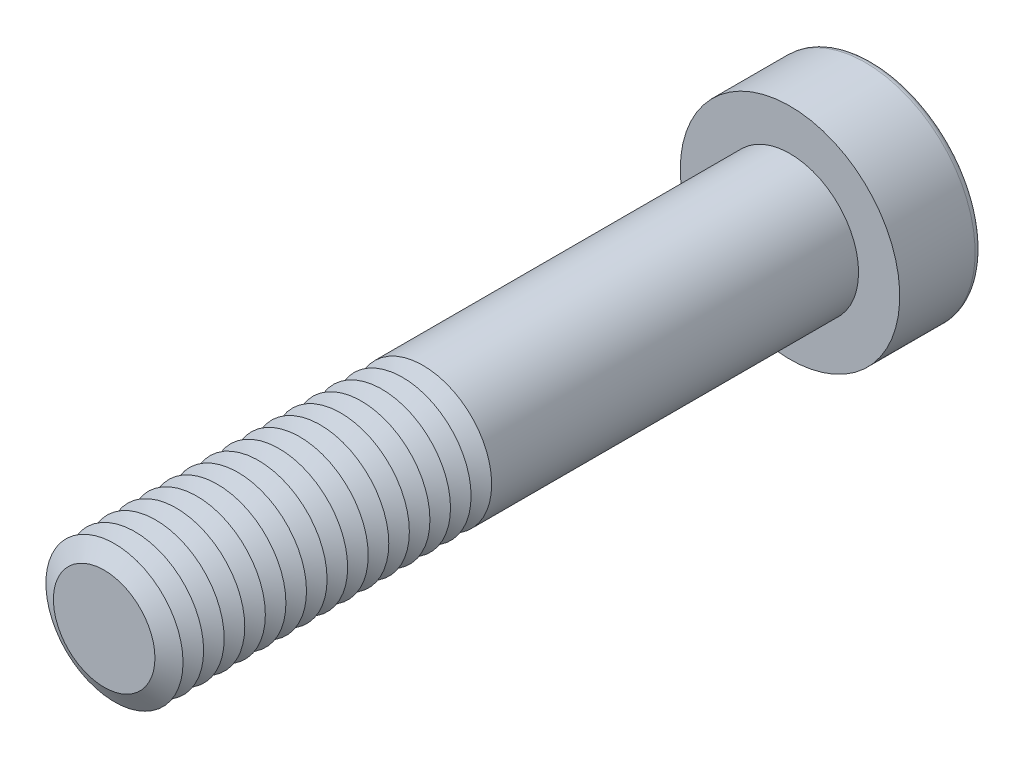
ISO-10303-21;
HEADER;
FILE_DESCRIPTION(('STEP AP214'),'2;1');
FILE_NAME('part.step','',(''),(''),'','','');
FILE_SCHEMA(('AUTOMOTIVE_DESIGN { 1 0 10303 214 1 1 1 1 }'));
ENDSEC;
DATA;
#1=APPLICATION_CONTEXT('core data for automotive mechanical design processes');
#2=APPLICATION_PROTOCOL_DEFINITION('international standard','automotive_design',2000,#1);
#3=PRODUCT_CONTEXT('',#1,'mechanical');
#4=PRODUCT('Part','Part','',(#3));
#5=PRODUCT_RELATED_PRODUCT_CATEGORY('part','',(#4));
#6=PRODUCT_DEFINITION_FORMATION('','',#4);
#7=PRODUCT_DEFINITION_CONTEXT('part definition',#1,'design');
#8=PRODUCT_DEFINITION('design','',#6,#7);
#9=PRODUCT_DEFINITION_SHAPE('','',#8);
#10=(LENGTH_UNIT() NAMED_UNIT(*) SI_UNIT(.MILLI.,.METRE.));
#11=(NAMED_UNIT(*) PLANE_ANGLE_UNIT() SI_UNIT($,.RADIAN.));
#12=(NAMED_UNIT(*) SI_UNIT($,.STERADIAN.) SOLID_ANGLE_UNIT());
#13=UNCERTAINTY_MEASURE_WITH_UNIT(LENGTH_MEASURE(1.E-05),#10,'distance_accuracy_value','');
#14=(GEOMETRIC_REPRESENTATION_CONTEXT(3) GLOBAL_UNCERTAINTY_ASSIGNED_CONTEXT((#13)) GLOBAL_UNIT_ASSIGNED_CONTEXT((#10,
#11,#12)) REPRESENTATION_CONTEXT('',''));
#15=CARTESIAN_POINT('',(0.,0.,0.));
#16=DIRECTION('',(0.,0.,1.));
#17=DIRECTION('',(1.,0.,0.));
#18=AXIS2_PLACEMENT_3D('',#15,#16,#17);
#19=CARTESIAN_POINT('',(0.,0.,44.75));
#20=DIRECTION('',(0.,0.,1.));
#21=DIRECTION('',(1.,0.,0.));
#22=AXIS2_PLACEMENT_3D('',#19,#20,#21);
#23=CONICAL_SURFACE('',#22,5.,1.0471975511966);
#24=CARTESIAN_POINT('',(0.,0.,44.));
#25=DIRECTION('',(0.,0.,1.));
#26=DIRECTION('',(1.,0.,0.));
#27=AXIS2_PLACEMENT_3D('',#24,#25,#26);
#28=CIRCLE('',#27,3.70096189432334);
#29=CARTESIAN_POINT('',(3.70096189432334,0.,44.));
#30=VERTEX_POINT('',#29);
#31=EDGE_CURVE('E314',#30,#30,#28,.T.);
#32=ORIENTED_EDGE('',*,*,#31,.T.);
#33=EDGE_LOOP('',(#32));
#34=FACE_BOUND('',#33,.T.);
#35=CARTESIAN_POINT('',(0.,0.,44.75));
#36=DIRECTION('',(0.,0.,1.));
#37=DIRECTION('',(1.,0.,0.));
#38=AXIS2_PLACEMENT_3D('',#35,#36,#37);
#39=CIRCLE('',#38,5.);
#40=CARTESIAN_POINT('',(5.,0.,44.75));
#41=VERTEX_POINT('',#40);
#42=EDGE_CURVE('E317',#41,#41,#39,.T.);
#43=ORIENTED_EDGE('',*,*,#42,.F.);
#44=EDGE_LOOP('',(#43));
#45=FACE_BOUND('',#44,.T.);
#46=ADVANCED_FACE('F39',(#34,#45),#23,.T.);
#47=CARTESIAN_POINT('',(0.,0.,44.));
#48=DIRECTION('',(0.,0.,-1.));
#49=DIRECTION('',(-1.,0.,0.));
#50=AXIS2_PLACEMENT_3D('',#47,#48,#49);
#51=CONICAL_SURFACE('',#50,3.70096189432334,1.0471975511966);
#52=CARTESIAN_POINT('',(0.,0.,43.25));
#53=DIRECTION('',(0.,0.,1.));
#54=DIRECTION('',(1.,0.,0.));
#55=AXIS2_PLACEMENT_3D('',#52,#53,#54);
#56=CIRCLE('',#55,5.);
#57=CARTESIAN_POINT('',(5.,0.,43.25));
#58=VERTEX_POINT('',#57);
#59=EDGE_CURVE('E325',#58,#58,#56,.T.);
#60=ORIENTED_EDGE('',*,*,#59,.T.);
#61=EDGE_LOOP('',(#60));
#62=FACE_BOUND('',#61,.T.);
#63=ORIENTED_EDGE('',*,*,#31,.F.);
#64=EDGE_LOOP('',(#63));
#65=FACE_BOUND('',#64,.T.);
#66=ADVANCED_FACE('F245',(#62,#65),#51,.T.);
#67=CARTESIAN_POINT('',(0.,0.,50.));
#68=DIRECTION('',(0.,0.,1.));
#69=DIRECTION('',(1.,0.,0.));
#70=AXIS2_PLACEMENT_3D('',#67,#68,#69);
#71=PLANE('',#70);
#72=CARTESIAN_POINT('',(0.,0.,50.));
#73=DIRECTION('',(0.,0.,1.));
#74=DIRECTION('',(1.,0.,0.));
#75=AXIS2_PLACEMENT_3D('',#72,#73,#74);
#76=CIRCLE('',#75,3.70096189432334);
#77=CARTESIAN_POINT('',(3.70096189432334,0.,50.));
#78=VERTEX_POINT('',#77);
#79=EDGE_CURVE('E174',#78,#78,#76,.T.);
#80=ORIENTED_EDGE('',*,*,#79,.T.);
#81=EDGE_LOOP('',(#80));
#82=FACE_BOUND('',#81,.T.);
#83=ADVANCED_FACE('F251',(#82),#71,.T.);
#84=CARTESIAN_POINT('',(0.,0.,50.));
#85=DIRECTION('',(0.,0.,-1.));
#86=DIRECTION('',(-1.,0.,0.));
#87=AXIS2_PLACEMENT_3D('',#84,#85,#86);
#88=CONICAL_SURFACE('',#87,3.70096189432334,1.0471975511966);
#89=CARTESIAN_POINT('',(0.,0.,49.25));
#90=DIRECTION('',(0.,0.,1.));
#91=DIRECTION('',(1.,0.,0.));
#92=AXIS2_PLACEMENT_3D('',#89,#90,#91);
#93=CIRCLE('',#92,5.);
#94=CARTESIAN_POINT('',(5.,0.,49.25));
#95=VERTEX_POINT('',#94);
#96=EDGE_CURVE('E291',#95,#95,#93,.T.);
#97=ORIENTED_EDGE('',*,*,#96,.T.);
#98=EDGE_LOOP('',(#97));
#99=FACE_BOUND('',#98,.T.);
#100=ORIENTED_EDGE('',*,*,#79,.F.);
#101=EDGE_LOOP('',(#100));
#102=FACE_BOUND('',#101,.T.);
#103=ADVANCED_FACE('F199',(#99,#102),#88,.T.);
#104=CARTESIAN_POINT('',(0.,0.,49.25));
#105=DIRECTION('',(0.,0.,1.));
#106=DIRECTION('',(1.,0.,0.));
#107=AXIS2_PLACEMENT_3D('',#104,#105,#106);
#108=CONICAL_SURFACE('',#107,5.,1.0471975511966);
#109=CARTESIAN_POINT('',(0.,0.,48.5));
#110=DIRECTION('',(0.,0.,1.));
#111=DIRECTION('',(1.,0.,0.));
#112=AXIS2_PLACEMENT_3D('',#109,#110,#111);
#113=CIRCLE('',#112,3.70096189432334);
#114=CARTESIAN_POINT('',(3.70096189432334,0.,48.5));
#115=VERTEX_POINT('',#114);
#116=EDGE_CURVE('E288',#115,#115,#113,.T.);
#117=ORIENTED_EDGE('',*,*,#116,.T.);
#118=EDGE_LOOP('',(#117));
#119=FACE_BOUND('',#118,.T.);
#120=ORIENTED_EDGE('',*,*,#96,.F.);
#121=EDGE_LOOP('',(#120));
#122=FACE_BOUND('',#121,.T.);
#123=ADVANCED_FACE('F277',(#119,#122),#108,.T.);
#124=CARTESIAN_POINT('',(0.,0.,48.5));
#125=DIRECTION('',(0.,0.,-1.));
#126=DIRECTION('',(-1.,0.,0.));
#127=AXIS2_PLACEMENT_3D('',#124,#125,#126);
#128=CONICAL_SURFACE('',#127,3.70096189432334,1.0471975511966);
#129=CARTESIAN_POINT('',(0.,0.,47.75));
#130=DIRECTION('',(0.,0.,1.));
#131=DIRECTION('',(1.,0.,0.));
#132=AXIS2_PLACEMENT_3D('',#129,#130,#131);
#133=CIRCLE('',#132,5.);
#134=CARTESIAN_POINT('',(5.,0.,47.75));
#135=VERTEX_POINT('',#134);
#136=EDGE_CURVE('E300',#135,#135,#133,.T.);
#137=ORIENTED_EDGE('',*,*,#136,.T.);
#138=EDGE_LOOP('',(#137));
#139=FACE_BOUND('',#138,.T.);
#140=ORIENTED_EDGE('',*,*,#116,.F.);
#141=EDGE_LOOP('',(#140));
#142=FACE_BOUND('',#141,.T.);
#143=ADVANCED_FACE('F274',(#139,#142),#128,.T.);
#144=CARTESIAN_POINT('',(0.,0.,47.75));
#145=DIRECTION('',(0.,0.,1.));
#146=DIRECTION('',(1.,0.,0.));
#147=AXIS2_PLACEMENT_3D('',#144,#145,#146);
#148=CONICAL_SURFACE('',#147,5.,1.0471975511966);
#149=CARTESIAN_POINT('',(0.,0.,47.));
#150=DIRECTION('',(0.,0.,1.));
#151=DIRECTION('',(1.,0.,0.));
#152=AXIS2_PLACEMENT_3D('',#149,#150,#151);
#153=CIRCLE('',#152,3.70096189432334);
#154=CARTESIAN_POINT('',(3.70096189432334,0.,47.));
#155=VERTEX_POINT('',#154);
#156=EDGE_CURVE('E293',#155,#155,#153,.T.);
#157=ORIENTED_EDGE('',*,*,#156,.T.);
#158=EDGE_LOOP('',(#157));
#159=FACE_BOUND('',#158,.T.);
#160=ORIENTED_EDGE('',*,*,#136,.F.);
#161=EDGE_LOOP('',(#160));
#162=FACE_BOUND('',#161,.T.);
#163=ADVANCED_FACE('F270',(#159,#162),#148,.T.);
#164=CARTESIAN_POINT('',(0.,0.,47.));
#165=DIRECTION('',(0.,0.,-1.));
#166=DIRECTION('',(-1.,0.,0.));
#167=AXIS2_PLACEMENT_3D('',#164,#165,#166);
#168=CONICAL_SURFACE('',#167,3.70096189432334,1.0471975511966);
#169=CARTESIAN_POINT('',(0.,0.,46.25));
#170=DIRECTION('',(0.,0.,1.));
#171=DIRECTION('',(1.,0.,0.));
#172=AXIS2_PLACEMENT_3D('',#169,#170,#171);
#173=CIRCLE('',#172,5.);
#174=CARTESIAN_POINT('',(5.,0.,46.25));
#175=VERTEX_POINT('',#174);
#176=EDGE_CURVE('E310',#175,#175,#173,.T.);
#177=ORIENTED_EDGE('',*,*,#176,.T.);
#178=EDGE_LOOP('',(#177));
#179=FACE_BOUND('',#178,.T.);
#180=ORIENTED_EDGE('',*,*,#156,.F.);
#181=EDGE_LOOP('',(#180));
#182=FACE_BOUND('',#181,.T.);
#183=ADVANCED_FACE('F266',(#179,#182),#168,.T.);
#184=CARTESIAN_POINT('',(0.,0.,46.25));
#185=DIRECTION('',(0.,0.,1.));
#186=DIRECTION('',(1.,0.,0.));
#187=AXIS2_PLACEMENT_3D('',#184,#185,#186);
#188=CONICAL_SURFACE('',#187,5.,1.0471975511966);
#189=CARTESIAN_POINT('',(0.,0.,45.5));
#190=DIRECTION('',(0.,0.,1.));
#191=DIRECTION('',(1.,0.,0.));
#192=AXIS2_PLACEMENT_3D('',#189,#190,#191);
#193=CIRCLE('',#192,3.70096189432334);
#194=CARTESIAN_POINT('',(3.70096189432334,0.,45.5));
#195=VERTEX_POINT('',#194);
#196=EDGE_CURVE('E306',#195,#195,#193,.T.);
#197=ORIENTED_EDGE('',*,*,#196,.T.);
#198=EDGE_LOOP('',(#197));
#199=FACE_BOUND('',#198,.T.);
#200=ORIENTED_EDGE('',*,*,#176,.F.);
#201=EDGE_LOOP('',(#200));
#202=FACE_BOUND('',#201,.T.);
#203=ADVANCED_FACE('F262',(#199,#202),#188,.T.);
#204=CARTESIAN_POINT('',(0.,0.,45.5));
#205=DIRECTION('',(0.,0.,-1.));
#206=DIRECTION('',(-1.,0.,0.));
#207=AXIS2_PLACEMENT_3D('',#204,#205,#206);
#208=CONICAL_SURFACE('',#207,3.70096189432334,1.0471975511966);
#209=ORIENTED_EDGE('',*,*,#42,.T.);
#210=EDGE_LOOP('',(#209));
#211=FACE_BOUND('',#210,.T.);
#212=ORIENTED_EDGE('',*,*,#196,.F.);
#213=EDGE_LOOP('',(#212));
#214=FACE_BOUND('',#213,.T.);
#215=ADVANCED_FACE('F258',(#211,#214),#208,.T.);
#216=CARTESIAN_POINT('',(0.,0.,43.25));
#217=DIRECTION('',(0.,0.,1.));
#218=DIRECTION('',(1.,0.,0.));
#219=AXIS2_PLACEMENT_3D('',#216,#217,#218);
#220=CONICAL_SURFACE('',#219,5.,1.0471975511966);
#221=CARTESIAN_POINT('',(0.,0.,42.5));
#222=DIRECTION('',(0.,0.,1.));
#223=DIRECTION('',(1.,0.,0.));
#224=AXIS2_PLACEMENT_3D('',#221,#222,#223);
#225=CIRCLE('',#224,3.70096189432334);
#226=CARTESIAN_POINT('',(3.70096189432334,0.,42.5));
#227=VERTEX_POINT('',#226);
#228=EDGE_CURVE('E321',#227,#227,#225,.T.);
#229=ORIENTED_EDGE('',*,*,#228,.T.);
#230=EDGE_LOOP('',(#229));
#231=FACE_BOUND('',#230,.T.);
#232=ORIENTED_EDGE('',*,*,#59,.F.);
#233=EDGE_LOOP('',(#232));
#234=FACE_BOUND('',#233,.T.);
#235=ADVANCED_FACE('F261',(#231,#234),#220,.T.);
#236=CARTESIAN_POINT('',(0.,0.,42.5));
#237=DIRECTION('',(0.,0.,-1.));
#238=DIRECTION('',(-1.,0.,0.));
#239=AXIS2_PLACEMENT_3D('',#236,#237,#238);
#240=CONICAL_SURFACE('',#239,3.70096189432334,1.0471975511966);
#241=CARTESIAN_POINT('',(0.,0.,41.75));
#242=DIRECTION('',(0.,0.,1.));
#243=DIRECTION('',(1.,0.,0.));
#244=AXIS2_PLACEMENT_3D('',#241,#242,#243);
#245=CIRCLE('',#244,5.);
#246=CARTESIAN_POINT('',(5.,0.,41.75));
#247=VERTEX_POINT('',#246);
#248=EDGE_CURVE('E333',#247,#247,#245,.T.);
#249=ORIENTED_EDGE('',*,*,#248,.T.);
#250=EDGE_LOOP('',(#249));
#251=FACE_BOUND('',#250,.T.);
#252=ORIENTED_EDGE('',*,*,#228,.F.);
#253=EDGE_LOOP('',(#252));
#254=FACE_BOUND('',#253,.T.);
#255=ADVANCED_FACE('F497',(#251,#254),#240,.T.);
#256=CARTESIAN_POINT('',(0.,0.,41.75));
#257=DIRECTION('',(0.,0.,1.));
#258=DIRECTION('',(1.,0.,0.));
#259=AXIS2_PLACEMENT_3D('',#256,#257,#258);
#260=CONICAL_SURFACE('',#259,5.,1.0471975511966);
#261=CARTESIAN_POINT('',(0.,0.,41.));
#262=DIRECTION('',(0.,0.,1.));
#263=DIRECTION('',(1.,0.,0.));
#264=AXIS2_PLACEMENT_3D('',#261,#262,#263);
#265=CIRCLE('',#264,3.70096189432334);
#266=CARTESIAN_POINT('',(3.70096189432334,0.,41.));
#267=VERTEX_POINT('',#266);
#268=EDGE_CURVE('E329',#267,#267,#265,.T.);
#269=ORIENTED_EDGE('',*,*,#268,.T.);
#270=EDGE_LOOP('',(#269));
#271=FACE_BOUND('',#270,.T.);
#272=ORIENTED_EDGE('',*,*,#248,.F.);
#273=EDGE_LOOP('',(#272));
#274=FACE_BOUND('',#273,.T.);
#275=ADVANCED_FACE('F493',(#271,#274),#260,.T.);
#276=CARTESIAN_POINT('',(0.,0.,41.));
#277=DIRECTION('',(0.,0.,-1.));
#278=DIRECTION('',(-1.,0.,0.));
#279=AXIS2_PLACEMENT_3D('',#276,#277,#278);
#280=CONICAL_SURFACE('',#279,3.70096189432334,1.0471975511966);
#281=CARTESIAN_POINT('',(0.,0.,40.25));
#282=DIRECTION('',(0.,0.,1.));
#283=DIRECTION('',(1.,0.,0.));
#284=AXIS2_PLACEMENT_3D('',#281,#282,#283);
#285=CIRCLE('',#284,5.);
#286=CARTESIAN_POINT('',(5.,0.,40.25));
#287=VERTEX_POINT('',#286);
#288=EDGE_CURVE('E341',#287,#287,#285,.T.);
#289=ORIENTED_EDGE('',*,*,#288,.T.);
#290=EDGE_LOOP('',(#289));
#291=FACE_BOUND('',#290,.T.);
#292=ORIENTED_EDGE('',*,*,#268,.F.);
#293=EDGE_LOOP('',(#292));
#294=FACE_BOUND('',#293,.T.);
#295=ADVANCED_FACE('F489',(#291,#294),#280,.T.);
#296=CARTESIAN_POINT('',(0.,0.,40.25));
#297=DIRECTION('',(0.,0.,1.));
#298=DIRECTION('',(1.,0.,0.));
#299=AXIS2_PLACEMENT_3D('',#296,#297,#298);
#300=CONICAL_SURFACE('',#299,5.,1.0471975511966);
#301=CARTESIAN_POINT('',(0.,0.,39.5));
#302=DIRECTION('',(0.,0.,1.));
#303=DIRECTION('',(1.,0.,0.));
#304=AXIS2_PLACEMENT_3D('',#301,#302,#303);
#305=CIRCLE('',#304,3.70096189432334);
#306=CARTESIAN_POINT('',(3.70096189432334,0.,39.5));
#307=VERTEX_POINT('',#306);
#308=EDGE_CURVE('E337',#307,#307,#305,.T.);
#309=ORIENTED_EDGE('',*,*,#308,.T.);
#310=EDGE_LOOP('',(#309));
#311=FACE_BOUND('',#310,.T.);
#312=ORIENTED_EDGE('',*,*,#288,.F.);
#313=EDGE_LOOP('',(#312));
#314=FACE_BOUND('',#313,.T.);
#315=ADVANCED_FACE('F485',(#311,#314),#300,.T.);
#316=CARTESIAN_POINT('',(0.,0.,39.5));
#317=DIRECTION('',(0.,0.,-1.));
#318=DIRECTION('',(-1.,0.,0.));
#319=AXIS2_PLACEMENT_3D('',#316,#317,#318);
#320=CONICAL_SURFACE('',#319,3.70096189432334,1.0471975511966);
#321=CARTESIAN_POINT('',(0.,0.,38.75));
#322=DIRECTION('',(0.,0.,1.));
#323=DIRECTION('',(1.,0.,0.));
#324=AXIS2_PLACEMENT_3D('',#321,#322,#323);
#325=CIRCLE('',#324,5.);
#326=CARTESIAN_POINT('',(5.,0.,38.75));
#327=VERTEX_POINT('',#326);
#328=EDGE_CURVE('E349',#327,#327,#325,.T.);
#329=ORIENTED_EDGE('',*,*,#328,.T.);
#330=EDGE_LOOP('',(#329));
#331=FACE_BOUND('',#330,.T.);
#332=ORIENTED_EDGE('',*,*,#308,.F.);
#333=EDGE_LOOP('',(#332));
#334=FACE_BOUND('',#333,.T.);
#335=ADVANCED_FACE('F481',(#331,#334),#320,.T.);
#336=CARTESIAN_POINT('',(0.,0.,38.75));
#337=DIRECTION('',(0.,0.,1.));
#338=DIRECTION('',(1.,0.,0.));
#339=AXIS2_PLACEMENT_3D('',#336,#337,#338);
#340=CONICAL_SURFACE('',#339,5.,1.0471975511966);
#341=CARTESIAN_POINT('',(0.,0.,38.));
#342=DIRECTION('',(0.,0.,1.));
#343=DIRECTION('',(1.,0.,0.));
#344=AXIS2_PLACEMENT_3D('',#341,#342,#343);
#345=CIRCLE('',#344,3.70096189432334);
#346=CARTESIAN_POINT('',(3.70096189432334,0.,38.));
#347=VERTEX_POINT('',#346);
#348=EDGE_CURVE('E345',#347,#347,#345,.T.);
#349=ORIENTED_EDGE('',*,*,#348,.T.);
#350=EDGE_LOOP('',(#349));
#351=FACE_BOUND('',#350,.T.);
#352=ORIENTED_EDGE('',*,*,#328,.F.);
#353=EDGE_LOOP('',(#352));
#354=FACE_BOUND('',#353,.T.);
#355=ADVANCED_FACE('F477',(#351,#354),#340,.T.);
#356=CARTESIAN_POINT('',(0.,0.,38.));
#357=DIRECTION('',(0.,0.,-1.));
#358=DIRECTION('',(-1.,0.,0.));
#359=AXIS2_PLACEMENT_3D('',#356,#357,#358);
#360=CONICAL_SURFACE('',#359,3.70096189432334,1.0471975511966);
#361=CARTESIAN_POINT('',(0.,0.,37.25));
#362=DIRECTION('',(0.,0.,1.));
#363=DIRECTION('',(1.,0.,0.));
#364=AXIS2_PLACEMENT_3D('',#361,#362,#363);
#365=CIRCLE('',#364,5.);
#366=CARTESIAN_POINT('',(5.,0.,37.25));
#367=VERTEX_POINT('',#366);
#368=EDGE_CURVE('E357',#367,#367,#365,.T.);
#369=ORIENTED_EDGE('',*,*,#368,.T.);
#370=EDGE_LOOP('',(#369));
#371=FACE_BOUND('',#370,.T.);
#372=ORIENTED_EDGE('',*,*,#348,.F.);
#373=EDGE_LOOP('',(#372));
#374=FACE_BOUND('',#373,.T.);
#375=ADVANCED_FACE('F473',(#371,#374),#360,.T.);
#376=CARTESIAN_POINT('',(0.,0.,37.25));
#377=DIRECTION('',(0.,0.,1.));
#378=DIRECTION('',(1.,0.,0.));
#379=AXIS2_PLACEMENT_3D('',#376,#377,#378);
#380=CONICAL_SURFACE('',#379,5.,1.0471975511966);
#381=CARTESIAN_POINT('',(0.,0.,36.5));
#382=DIRECTION('',(0.,0.,1.));
#383=DIRECTION('',(1.,0.,0.));
#384=AXIS2_PLACEMENT_3D('',#381,#382,#383);
#385=CIRCLE('',#384,3.70096189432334);
#386=CARTESIAN_POINT('',(3.70096189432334,0.,36.5));
#387=VERTEX_POINT('',#386);
#388=EDGE_CURVE('E353',#387,#387,#385,.T.);
#389=ORIENTED_EDGE('',*,*,#388,.T.);
#390=EDGE_LOOP('',(#389));
#391=FACE_BOUND('',#390,.T.);
#392=ORIENTED_EDGE('',*,*,#368,.F.);
#393=EDGE_LOOP('',(#392));
#394=FACE_BOUND('',#393,.T.);
#395=ADVANCED_FACE('F469',(#391,#394),#380,.T.);
#396=CARTESIAN_POINT('',(0.,0.,36.5));
#397=DIRECTION('',(0.,0.,-1.));
#398=DIRECTION('',(-1.,0.,0.));
#399=AXIS2_PLACEMENT_3D('',#396,#397,#398);
#400=CONICAL_SURFACE('',#399,3.70096189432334,1.0471975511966);
#401=CARTESIAN_POINT('',(0.,0.,35.75));
#402=DIRECTION('',(0.,0.,1.));
#403=DIRECTION('',(1.,0.,0.));
#404=AXIS2_PLACEMENT_3D('',#401,#402,#403);
#405=CIRCLE('',#404,5.);
#406=CARTESIAN_POINT('',(5.,0.,35.75));
#407=VERTEX_POINT('',#406);
#408=EDGE_CURVE('E365',#407,#407,#405,.T.);
#409=ORIENTED_EDGE('',*,*,#408,.T.);
#410=EDGE_LOOP('',(#409));
#411=FACE_BOUND('',#410,.T.);
#412=ORIENTED_EDGE('',*,*,#388,.F.);
#413=EDGE_LOOP('',(#412));
#414=FACE_BOUND('',#413,.T.);
#415=ADVANCED_FACE('F465',(#411,#414),#400,.T.);
#416=CARTESIAN_POINT('',(0.,0.,35.75));
#417=DIRECTION('',(0.,0.,1.));
#418=DIRECTION('',(1.,0.,0.));
#419=AXIS2_PLACEMENT_3D('',#416,#417,#418);
#420=CONICAL_SURFACE('',#419,5.,1.0471975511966);
#421=CARTESIAN_POINT('',(0.,0.,35.));
#422=DIRECTION('',(0.,0.,1.));
#423=DIRECTION('',(1.,0.,0.));
#424=AXIS2_PLACEMENT_3D('',#421,#422,#423);
#425=CIRCLE('',#424,3.70096189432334);
#426=CARTESIAN_POINT('',(3.70096189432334,0.,35.));
#427=VERTEX_POINT('',#426);
#428=EDGE_CURVE('E361',#427,#427,#425,.T.);
#429=ORIENTED_EDGE('',*,*,#428,.T.);
#430=EDGE_LOOP('',(#429));
#431=FACE_BOUND('',#430,.T.);
#432=ORIENTED_EDGE('',*,*,#408,.F.);
#433=EDGE_LOOP('',(#432));
#434=FACE_BOUND('',#433,.T.);
#435=ADVANCED_FACE('F461',(#431,#434),#420,.T.);
#436=CARTESIAN_POINT('',(0.,0.,35.));
#437=DIRECTION('',(0.,0.,-1.));
#438=DIRECTION('',(-1.,0.,0.));
#439=AXIS2_PLACEMENT_3D('',#436,#437,#438);
#440=CONICAL_SURFACE('',#439,3.70096189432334,1.0471975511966);
#441=CARTESIAN_POINT('',(0.,0.,34.25));
#442=DIRECTION('',(0.,0.,1.));
#443=DIRECTION('',(1.,0.,0.));
#444=AXIS2_PLACEMENT_3D('',#441,#442,#443);
#445=CIRCLE('',#444,5.);
#446=CARTESIAN_POINT('',(5.,0.,34.25));
#447=VERTEX_POINT('',#446);
#448=EDGE_CURVE('E373',#447,#447,#445,.T.);
#449=ORIENTED_EDGE('',*,*,#448,.T.);
#450=EDGE_LOOP('',(#449));
#451=FACE_BOUND('',#450,.T.);
#452=ORIENTED_EDGE('',*,*,#428,.F.);
#453=EDGE_LOOP('',(#452));
#454=FACE_BOUND('',#453,.T.);
#455=ADVANCED_FACE('F457',(#451,#454),#440,.T.);
#456=CARTESIAN_POINT('',(0.,0.,34.25));
#457=DIRECTION('',(0.,0.,1.));
#458=DIRECTION('',(1.,0.,0.));
#459=AXIS2_PLACEMENT_3D('',#456,#457,#458);
#460=CONICAL_SURFACE('',#459,5.,1.0471975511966);
#461=CARTESIAN_POINT('',(0.,0.,33.5));
#462=DIRECTION('',(0.,0.,1.));
#463=DIRECTION('',(1.,0.,0.));
#464=AXIS2_PLACEMENT_3D('',#461,#462,#463);
#465=CIRCLE('',#464,3.70096189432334);
#466=CARTESIAN_POINT('',(3.70096189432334,0.,33.5));
#467=VERTEX_POINT('',#466);
#468=EDGE_CURVE('E369',#467,#467,#465,.T.);
#469=ORIENTED_EDGE('',*,*,#468,.T.);
#470=EDGE_LOOP('',(#469));
#471=FACE_BOUND('',#470,.T.);
#472=ORIENTED_EDGE('',*,*,#448,.F.);
#473=EDGE_LOOP('',(#472));
#474=FACE_BOUND('',#473,.T.);
#475=ADVANCED_FACE('F453',(#471,#474),#460,.T.);
#476=CARTESIAN_POINT('',(0.,0.,33.5));
#477=DIRECTION('',(0.,0.,-1.));
#478=DIRECTION('',(-1.,0.,0.));
#479=AXIS2_PLACEMENT_3D('',#476,#477,#478);
#480=CONICAL_SURFACE('',#479,3.70096189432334,1.0471975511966);
#481=CARTESIAN_POINT('',(0.,0.,32.75));
#482=DIRECTION('',(0.,0.,1.));
#483=DIRECTION('',(1.,0.,0.));
#484=AXIS2_PLACEMENT_3D('',#481,#482,#483);
#485=CIRCLE('',#484,5.);
#486=CARTESIAN_POINT('',(5.,0.,32.75));
#487=VERTEX_POINT('',#486);
#488=EDGE_CURVE('E381',#487,#487,#485,.T.);
#489=ORIENTED_EDGE('',*,*,#488,.T.);
#490=EDGE_LOOP('',(#489));
#491=FACE_BOUND('',#490,.T.);
#492=ORIENTED_EDGE('',*,*,#468,.F.);
#493=EDGE_LOOP('',(#492));
#494=FACE_BOUND('',#493,.T.);
#495=ADVANCED_FACE('F449',(#491,#494),#480,.T.);
#496=CARTESIAN_POINT('',(0.,0.,32.75));
#497=DIRECTION('',(0.,0.,1.));
#498=DIRECTION('',(1.,0.,0.));
#499=AXIS2_PLACEMENT_3D('',#496,#497,#498);
#500=CONICAL_SURFACE('',#499,5.,1.0471975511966);
#501=CARTESIAN_POINT('',(0.,0.,32.));
#502=DIRECTION('',(0.,0.,1.));
#503=DIRECTION('',(1.,0.,0.));
#504=AXIS2_PLACEMENT_3D('',#501,#502,#503);
#505=CIRCLE('',#504,3.70096189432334);
#506=CARTESIAN_POINT('',(3.70096189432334,0.,32.));
#507=VERTEX_POINT('',#506);
#508=EDGE_CURVE('E377',#507,#507,#505,.T.);
#509=ORIENTED_EDGE('',*,*,#508,.T.);
#510=EDGE_LOOP('',(#509));
#511=FACE_BOUND('',#510,.T.);
#512=ORIENTED_EDGE('',*,*,#488,.F.);
#513=EDGE_LOOP('',(#512));
#514=FACE_BOUND('',#513,.T.);
#515=ADVANCED_FACE('F445',(#511,#514),#500,.T.);
#516=CARTESIAN_POINT('',(0.,0.,32.));
#517=DIRECTION('',(0.,0.,-1.));
#518=DIRECTION('',(-1.,0.,0.));
#519=AXIS2_PLACEMENT_3D('',#516,#517,#518);
#520=CONICAL_SURFACE('',#519,3.70096189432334,1.0471975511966);
#521=CARTESIAN_POINT('',(0.,0.,31.25));
#522=DIRECTION('',(0.,0.,1.));
#523=DIRECTION('',(1.,0.,0.));
#524=AXIS2_PLACEMENT_3D('',#521,#522,#523);
#525=CIRCLE('',#524,5.);
#526=CARTESIAN_POINT('',(5.,0.,31.25));
#527=VERTEX_POINT('',#526);
#528=EDGE_CURVE('E388',#527,#527,#525,.T.);
#529=ORIENTED_EDGE('',*,*,#528,.T.);
#530=EDGE_LOOP('',(#529));
#531=FACE_BOUND('',#530,.T.);
#532=ORIENTED_EDGE('',*,*,#508,.F.);
#533=EDGE_LOOP('',(#532));
#534=FACE_BOUND('',#533,.T.);
#535=ADVANCED_FACE('F441',(#531,#534),#520,.T.);
#536=CARTESIAN_POINT('',(0.,0.,31.25));
#537=DIRECTION('',(0.,0.,1.));
#538=DIRECTION('',(1.,0.,0.));
#539=AXIS2_PLACEMENT_3D('',#536,#537,#538);
#540=CONICAL_SURFACE('',#539,5.,1.0471975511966);
#541=CARTESIAN_POINT('',(0.,0.,30.5));
#542=DIRECTION('',(0.,0.,1.));
#543=DIRECTION('',(1.,0.,0.));
#544=AXIS2_PLACEMENT_3D('',#541,#542,#543);
#545=CIRCLE('',#544,3.70096189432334);
#546=CARTESIAN_POINT('',(3.70096189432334,0.,30.5));
#547=VERTEX_POINT('',#546);
#548=EDGE_CURVE('E384',#547,#547,#545,.T.);
#549=ORIENTED_EDGE('',*,*,#548,.T.);
#550=EDGE_LOOP('',(#549));
#551=FACE_BOUND('',#550,.T.);
#552=ORIENTED_EDGE('',*,*,#528,.F.);
#553=EDGE_LOOP('',(#552));
#554=FACE_BOUND('',#553,.T.);
#555=ADVANCED_FACE('F437',(#551,#554),#540,.T.);
#556=CARTESIAN_POINT('',(0.,0.,30.5));
#557=DIRECTION('',(0.,0.,-1.));
#558=DIRECTION('',(-1.,0.,0.));
#559=AXIS2_PLACEMENT_3D('',#556,#557,#558);
#560=CONICAL_SURFACE('',#559,3.70096189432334,1.0471975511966);
#561=CARTESIAN_POINT('',(0.,0.,29.75));
#562=DIRECTION('',(0.,0.,1.));
#563=DIRECTION('',(1.,0.,0.));
#564=AXIS2_PLACEMENT_3D('',#561,#562,#563);
#565=CIRCLE('',#564,5.);
#566=CARTESIAN_POINT('',(5.,0.,29.75));
#567=VERTEX_POINT('',#566);
#568=EDGE_CURVE('E396',#567,#567,#565,.T.);
#569=ORIENTED_EDGE('',*,*,#568,.T.);
#570=EDGE_LOOP('',(#569));
#571=FACE_BOUND('',#570,.T.);
#572=ORIENTED_EDGE('',*,*,#548,.F.);
#573=EDGE_LOOP('',(#572));
#574=FACE_BOUND('',#573,.T.);
#575=ADVANCED_FACE('F433',(#571,#574),#560,.T.);
#576=CARTESIAN_POINT('',(0.,0.,29.75));
#577=DIRECTION('',(0.,0.,1.));
#578=DIRECTION('',(1.,0.,0.));
#579=AXIS2_PLACEMENT_3D('',#576,#577,#578);
#580=CONICAL_SURFACE('',#579,5.,1.0471975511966);
#581=CARTESIAN_POINT('',(0.,0.,29.));
#582=DIRECTION('',(0.,0.,1.));
#583=DIRECTION('',(1.,0.,0.));
#584=AXIS2_PLACEMENT_3D('',#581,#582,#583);
#585=CIRCLE('',#584,3.70096189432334);
#586=CARTESIAN_POINT('',(3.70096189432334,0.,29.));
#587=VERTEX_POINT('',#586);
#588=EDGE_CURVE('E392',#587,#587,#585,.T.);
#589=ORIENTED_EDGE('',*,*,#588,.T.);
#590=EDGE_LOOP('',(#589));
#591=FACE_BOUND('',#590,.T.);
#592=ORIENTED_EDGE('',*,*,#568,.F.);
#593=EDGE_LOOP('',(#592));
#594=FACE_BOUND('',#593,.T.);
#595=ADVANCED_FACE('F428',(#591,#594),#580,.T.);
#596=CARTESIAN_POINT('',(0.,0.,29.));
#597=DIRECTION('',(0.,0.,-1.));
#598=DIRECTION('',(-1.,0.,0.));
#599=AXIS2_PLACEMENT_3D('',#596,#597,#598);
#600=CONICAL_SURFACE('',#599,3.70096189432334,1.0471975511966);
#601=CARTESIAN_POINT('',(0.,0.,28.25));
#602=DIRECTION('',(0.,0.,1.));
#603=DIRECTION('',(1.,0.,0.));
#604=AXIS2_PLACEMENT_3D('',#601,#602,#603);
#605=CIRCLE('',#604,5.);
#606=CARTESIAN_POINT('',(5.,0.,28.25));
#607=VERTEX_POINT('',#606);
#608=EDGE_CURVE('E408',#607,#607,#605,.T.);
#609=ORIENTED_EDGE('',*,*,#608,.T.);
#610=EDGE_LOOP('',(#609));
#611=FACE_BOUND('',#610,.T.);
#612=ORIENTED_EDGE('',*,*,#588,.F.);
#613=EDGE_LOOP('',(#612));
#614=FACE_BOUND('',#613,.T.);
#615=ADVANCED_FACE('F414',(#611,#614),#600,.T.);
#616=CARTESIAN_POINT('',(0.,0.,28.25));
#617=DIRECTION('',(0.,0.,1.));
#618=DIRECTION('',(1.,0.,0.));
#619=AXIS2_PLACEMENT_3D('',#616,#617,#618);
#620=CONICAL_SURFACE('',#619,5.,1.0471975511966);
#621=CARTESIAN_POINT('',(0.,0.,27.5));
#622=DIRECTION('',(0.,0.,1.));
#623=DIRECTION('',(1.,0.,0.));
#624=AXIS2_PLACEMENT_3D('',#621,#622,#623);
#625=CIRCLE('',#624,3.70096189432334);
#626=CARTESIAN_POINT('',(3.70096189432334,0.,27.5));
#627=VERTEX_POINT('',#626);
#628=EDGE_CURVE('E400',#627,#627,#625,.T.);
#629=ORIENTED_EDGE('',*,*,#628,.T.);
#630=EDGE_LOOP('',(#629));
#631=FACE_BOUND('',#630,.T.);
#632=ORIENTED_EDGE('',*,*,#608,.F.);
#633=EDGE_LOOP('',(#632));
#634=FACE_BOUND('',#633,.T.);
#635=ADVANCED_FACE('F417',(#631,#634),#620,.T.);
#636=CARTESIAN_POINT('',(0.,0.,27.5));
#637=DIRECTION('',(0.,0.,-1.));
#638=DIRECTION('',(-1.,0.,0.));
#639=AXIS2_PLACEMENT_3D('',#636,#637,#638);
#640=CONICAL_SURFACE('',#639,3.70096189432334,1.0471975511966);
#641=CARTESIAN_POINT('',(0.,0.,26.75));
#642=DIRECTION('',(0.,0.,1.));
#643=DIRECTION('',(1.,0.,0.));
#644=AXIS2_PLACEMENT_3D('',#641,#642,#643);
#645=CIRCLE('',#644,5.);
#646=CARTESIAN_POINT('',(5.,0.,26.75));
#647=VERTEX_POINT('',#646);
#648=EDGE_CURVE('E404',#647,#647,#645,.T.);
#649=ORIENTED_EDGE('',*,*,#648,.T.);
#650=EDGE_LOOP('',(#649));
#651=FACE_BOUND('',#650,.T.);
#652=ORIENTED_EDGE('',*,*,#628,.F.);
#653=EDGE_LOOP('',(#652));
#654=FACE_BOUND('',#653,.T.);
#655=ADVANCED_FACE('F419',(#651,#654),#640,.T.);
#656=CARTESIAN_POINT('',(0.,0.,-0.75));
#657=DIRECTION('',(0.,0.,-1.));
#658=DIRECTION('',(-1.,0.,0.));
#659=AXIS2_PLACEMENT_3D('',#656,#657,#658);
#660=CONICAL_SURFACE('',#659,3.5,1.0471975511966);
#661=CARTESIAN_POINT('',(0.,0.,1.27072594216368));
#662=VERTEX_POINT('',#661);
#663=VERTEX_LOOP('',#662);
#664=FACE_BOUND('',#663,.T.);
#665=CARTESIAN_POINT('',(0.,0.,-0.75));
#666=DIRECTION('',(0.,0.,-1.));
#667=DIRECTION('',(-1.,0.,0.));
#668=AXIS2_PLACEMENT_3D('',#665,#666,#667);
#669=CIRCLE('',#668,3.5);
#670=CARTESIAN_POINT('',(-3.03108891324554,1.75,-0.75));
#671=VERTEX_POINT('',#670);
#672=CARTESIAN_POINT('',(0.,3.5,-0.75));
#673=VERTEX_POINT('',#672);
#674=EDGE_CURVE('E149',#671,#673,#669,.T.);
#675=ORIENTED_EDGE('',*,*,#674,.T.);
#676=CARTESIAN_POINT('',(0.,0.,-0.75));
#677=DIRECTION('',(0.,0.,-1.));
#678=DIRECTION('',(-1.,0.,0.));
#679=AXIS2_PLACEMENT_3D('',#676,#677,#678);
#680=CIRCLE('',#679,3.5);
#681=CARTESIAN_POINT('',(3.03108891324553,1.75,-0.75));
#682=VERTEX_POINT('',#681);
#683=EDGE_CURVE('E54',#673,#682,#680,.T.);
#684=ORIENTED_EDGE('',*,*,#683,.T.);
#685=CARTESIAN_POINT('',(3.03108891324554,-1.75,-0.75));
#686=VERTEX_POINT('',#685);
#687=EDGE_CURVE('E998',#682,#686,#680,.T.);
#688=ORIENTED_EDGE('',*,*,#687,.T.);
#689=CARTESIAN_POINT('',(0.,-3.5,-0.75));
#690=VERTEX_POINT('',#689);
#691=EDGE_CURVE('E996',#686,#690,#680,.T.);
#692=ORIENTED_EDGE('',*,*,#691,.T.);
#693=CARTESIAN_POINT('',(-3.03108891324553,-1.75,-0.75));
#694=VERTEX_POINT('',#693);
#695=EDGE_CURVE('E990',#690,#694,#680,.T.);
#696=ORIENTED_EDGE('',*,*,#695,.T.);
#697=EDGE_CURVE('E989',#694,#671,#680,.T.);
#698=ORIENTED_EDGE('',*,*,#697,.T.);
#699=EDGE_LOOP('',(#675,#684,#688,#692,#696,#698));
#700=FACE_BOUND('',#699,.T.);
#701=ADVANCED_FACE('F201',(#664,#700),#660,.F.);
#702=CARTESIAN_POINT('',(0.,0.,-0.75));
#703=DIRECTION('',(0.,0.,-1.));
#704=DIRECTION('',(-1.,0.,0.));
#705=AXIS2_PLACEMENT_3D('',#702,#703,#704);
#706=PLANE('',#705);
#707=ORIENTED_EDGE('',*,*,#683,.F.);
#708=DIRECTION('',(1.,0.,0.));
#709=VECTOR('',#708,1.);
#710=CARTESIAN_POINT('',(-2.02072594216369,3.5,-0.75));
#711=LINE('',#710,#709);
#712=CARTESIAN_POINT('',(2.02072594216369,3.5,-0.75));
#713=VERTEX_POINT('',#712);
#714=EDGE_CURVE('E1036',#673,#713,#711,.T.);
#715=ORIENTED_EDGE('',*,*,#714,.T.);
#716=DIRECTION('',(0.5,-0.866025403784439,0.));
#717=VECTOR('',#716,1.);
#718=CARTESIAN_POINT('',(2.02072594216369,3.5,-0.75));
#719=LINE('',#718,#717);
#720=EDGE_CURVE('E155',#713,#682,#719,.T.);
#721=ORIENTED_EDGE('',*,*,#720,.T.);
#722=EDGE_LOOP('',(#707,#715,#721));
#723=FACE_BOUND('',#722,.T.);
#724=ADVANCED_FACE('F586',(#723),#706,.T.);
#725=ORIENTED_EDGE('',*,*,#687,.F.);
#726=CARTESIAN_POINT('',(4.04145188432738,0.,-0.75));
#727=VERTEX_POINT('',#726);
#728=EDGE_CURVE('E1039',#682,#727,#719,.T.);
#729=ORIENTED_EDGE('',*,*,#728,.T.);
#730=DIRECTION('',(-0.5,-0.866025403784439,0.));
#731=VECTOR('',#730,1.);
#732=CARTESIAN_POINT('',(4.04145188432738,0.,-0.75));
#733=LINE('',#732,#731);
#734=EDGE_CURVE('E1012',#727,#686,#733,.T.);
#735=ORIENTED_EDGE('',*,*,#734,.T.);
#736=EDGE_LOOP('',(#725,#729,#735));
#737=FACE_BOUND('',#736,.T.);
#738=ADVANCED_FACE('F596',(#737),#706,.T.);
#739=ORIENTED_EDGE('',*,*,#691,.F.);
#740=CARTESIAN_POINT('',(2.02072594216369,-3.5,-0.75));
#741=VERTEX_POINT('',#740);
#742=EDGE_CURVE('E1014',#686,#741,#733,.T.);
#743=ORIENTED_EDGE('',*,*,#742,.T.);
#744=DIRECTION('',(-1.,0.,0.));
#745=VECTOR('',#744,1.);
#746=CARTESIAN_POINT('',(2.02072594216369,-3.5,-0.75));
#747=LINE('',#746,#745);
#748=EDGE_CURVE('E964',#741,#690,#747,.T.);
#749=ORIENTED_EDGE('',*,*,#748,.T.);
#750=EDGE_LOOP('',(#739,#743,#749));
#751=FACE_BOUND('',#750,.T.);
#752=ADVANCED_FACE('F606',(#751),#706,.T.);
#753=ORIENTED_EDGE('',*,*,#695,.F.);
#754=CARTESIAN_POINT('',(-2.02072594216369,-3.5,-0.75));
#755=VERTEX_POINT('',#754);
#756=EDGE_CURVE('E1009',#690,#755,#747,.T.);
#757=ORIENTED_EDGE('',*,*,#756,.T.);
#758=DIRECTION('',(-0.5,0.866025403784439,0.));
#759=VECTOR('',#758,1.);
#760=CARTESIAN_POINT('',(-2.02072594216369,-3.5,-0.75));
#761=LINE('',#760,#759);
#762=EDGE_CURVE('E1011',#755,#694,#761,.T.);
#763=ORIENTED_EDGE('',*,*,#762,.T.);
#764=EDGE_LOOP('',(#753,#757,#763));
#765=FACE_BOUND('',#764,.T.);
#766=ADVANCED_FACE('F614',(#765),#706,.T.);
#767=ORIENTED_EDGE('',*,*,#697,.F.);
#768=CARTESIAN_POINT('',(-4.04145188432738,0.,-0.75));
#769=VERTEX_POINT('',#768);
#770=EDGE_CURVE('E1016',#694,#769,#761,.T.);
#771=ORIENTED_EDGE('',*,*,#770,.T.);
#772=DIRECTION('',(0.5,0.866025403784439,0.));
#773=VECTOR('',#772,1.);
#774=CARTESIAN_POINT('',(-4.04145188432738,0.,-0.75));
#775=LINE('',#774,#773);
#776=EDGE_CURVE('E158',#769,#671,#775,.T.);
#777=ORIENTED_EDGE('',*,*,#776,.T.);
#778=EDGE_LOOP('',(#767,#771,#777));
#779=FACE_BOUND('',#778,.T.);
#780=ADVANCED_FACE('F231',(#779),#706,.T.);
#781=ORIENTED_EDGE('',*,*,#674,.F.);
#782=CARTESIAN_POINT('',(-2.02072594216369,3.5,-0.75));
#783=VERTEX_POINT('',#782);
#784=EDGE_CURVE('E1023',#671,#783,#775,.T.);
#785=ORIENTED_EDGE('',*,*,#784,.T.);
#786=EDGE_CURVE('E1035',#783,#673,#711,.T.);
#787=ORIENTED_EDGE('',*,*,#786,.T.);
#788=EDGE_LOOP('',(#781,#785,#787));
#789=FACE_BOUND('',#788,.T.);
#790=ADVANCED_FACE('F598',(#789),#706,.T.);
#791=CARTESIAN_POINT('',(-2.02072594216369,3.5,-0.75));
#792=DIRECTION('',(0.,1.,0.));
#793=DIRECTION('',(-1.,0.,0.));
#794=AXIS2_PLACEMENT_3D('',#791,#792,#793);
#795=PLANE('',#794);
#796=DIRECTION('',(0.,0.,-1.));
#797=VECTOR('',#796,1.);
#798=CARTESIAN_POINT('',(-2.02072594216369,3.5,-0.75));
#799=LINE('',#798,#797);
#800=CARTESIAN_POINT('',(-2.02072594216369,3.5,-6.));
#801=VERTEX_POINT('',#800);
#802=EDGE_CURVE('E147',#783,#801,#799,.T.);
#803=ORIENTED_EDGE('',*,*,#802,.T.);
#804=CARTESIAN_POINT('',(-5.27521327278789,3.5,-6.613404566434));
#805=CARTESIAN_POINT('',(-5.11717138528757,3.5,-6.57812703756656));
#806=CARTESIAN_POINT('',(-4.95902873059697,3.5,-6.5432936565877));
#807=CARTESIAN_POINT('',(-4.64249233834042,3.5,-6.47475322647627));
#808=CARTESIAN_POINT('',(-4.48409858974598,3.5,-6.44104622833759));
#809=CARTESIAN_POINT('',(-4.16686075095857,3.5,-6.37496567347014));
#810=CARTESIAN_POINT('',(-4.00801636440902,3.5,-6.34259353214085));
#811=CARTESIAN_POINT('',(-3.68999232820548,3.5,-6.27954992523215));
#812=CARTESIAN_POINT('',(-3.53081268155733,3.5,-6.24887844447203));
#813=CARTESIAN_POINT('',(-3.05545711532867,3.5,-6.16049717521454));
#814=CARTESIAN_POINT('',(-2.73870333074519,3.5,-6.10583257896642));
#815=CARTESIAN_POINT('',(-2.10326379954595,3.5,-6.00899390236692));
#816=CARTESIAN_POINT('',(-1.78457845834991,3.5,-5.9668172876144));
#817=CARTESIAN_POINT('',(-1.30331397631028,3.5,-5.91703310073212));
#818=CARTESIAN_POINT('',(-1.14143900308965,3.5,-5.90264327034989));
#819=CARTESIAN_POINT('',(-0.817296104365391,3.5,-5.87924021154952));
#820=CARTESIAN_POINT('',(-0.655028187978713,3.5,-5.87022685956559));
#821=CARTESIAN_POINT('',(-0.330337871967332,3.5,-5.8581019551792));
#822=CARTESIAN_POINT('',(-0.167915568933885,3.5,-5.85498786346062));
#823=CARTESIAN_POINT('',(0.156931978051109,3.5,-5.85485125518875));
#824=CARTESIAN_POINT('',(0.319357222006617,3.5,-5.8578287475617));
#825=CARTESIAN_POINT('',(0.644649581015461,3.5,-5.86971076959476));
#826=CARTESIAN_POINT('',(0.807515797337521,3.5,-5.87863941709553));
#827=CARTESIAN_POINT('',(1.13286152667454,3.5,-5.90192432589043));
#828=CARTESIAN_POINT('',(1.29534101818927,3.5,-5.91628088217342));
#829=CARTESIAN_POINT('',(1.61990955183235,3.5,-5.94971371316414));
#830=CARTESIAN_POINT('',(1.78199828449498,3.5,-5.96879294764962));
#831=CARTESIAN_POINT('',(2.10565606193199,3.5,-6.01089893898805));
#832=CARTESIAN_POINT('',(2.26722510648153,3.5,-6.03392569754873));
#833=CARTESIAN_POINT('',(2.59408673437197,3.5,-6.08385328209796));
#834=CARTESIAN_POINT('',(2.75936612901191,3.5,-6.11083971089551));
#835=CARTESIAN_POINT('',(3.08945524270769,3.5,-6.16755337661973));
#836=CARTESIAN_POINT('',(3.25426494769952,3.5,-6.19728069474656));
#837=CARTESIAN_POINT('',(3.74811783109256,3.5,-6.28973245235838));
#838=CARTESIAN_POINT('',(4.07654810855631,3.5,-6.35572082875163));
#839=CARTESIAN_POINT('',(4.73230999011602,3.5,-6.49329874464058));
#840=CARTESIAN_POINT('',(5.05964125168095,3.5,-6.56488988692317));
#841=CARTESIAN_POINT('',(5.71347161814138,3.5,-6.71179760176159));
#842=CARTESIAN_POINT('',(6.03997070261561,3.5,-6.78711426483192));
#843=CARTESIAN_POINT('',(6.68838444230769,3.5,-6.93936666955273));
#844=CARTESIAN_POINT('',(7.01030641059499,3.5,-7.01627142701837));
#845=CARTESIAN_POINT('',(7.65372712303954,3.5,-7.17185944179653));
#846=CARTESIAN_POINT('',(7.97522585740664,3.5,-7.25054273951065));
#847=CARTESIAN_POINT('',(8.61745492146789,3.5,-7.409094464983));
#848=CARTESIAN_POINT('',(8.93818569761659,3.5,-7.48896108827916));
#849=CARTESIAN_POINT('',(9.57938765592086,3.5,-7.64968154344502));
#850=CARTESIAN_POINT('',(9.89985884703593,3.5,-7.73053533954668));
#851=CARTESIAN_POINT('',(10.2202418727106,3.5,-7.81173318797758));
#852=B_SPLINE_CURVE_WITH_KNOTS('',3,(#804,#805,#806,#807,#808,#809,#810,#811,#812,#813,#814,
#815,#816,#817,#818,#819,#820,#821,#822,#823,#824,#825,#826,#827,#828,#829,#830,#831,#832,#833,
#834,#835,#836,#837,#838,#839,#840,#841,#842,#843,#844,#845,#846,#847,#848,#849,#850,#851),
.UNSPECIFIED.,.F.,.F.,(4,2,2,2,2,2,2,2,2,2,2,2,2,2,2,2,2,2,2,2,2,2,2,4),(0.,0.485795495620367,
0.971612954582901,1.45793295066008,1.94424860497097,2.90841266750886,3.87238092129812,
4.35984584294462,4.84729956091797,5.33454340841,5.82178796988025,6.31101925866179,
6.80027713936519,7.28984242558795,7.77940792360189,8.28178329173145,8.78417354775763,
9.78906542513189,10.7942458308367,11.7994506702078,12.7923858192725,13.7853435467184,
14.7769174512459,15.7684555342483),.UNSPECIFIED.);
#853=CARTESIAN_POINT('',(2.02072594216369,3.5,-6.));
#854=VERTEX_POINT('',#853);
#855=EDGE_CURVE('E124',#801,#854,#852,.T.);
#856=ORIENTED_EDGE('',*,*,#855,.T.);
#857=DIRECTION('',(0.,0.,-1.));
#858=VECTOR('',#857,1.);
#859=CARTESIAN_POINT('',(2.02072594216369,3.5,-0.75));
#860=LINE('',#859,#858);
#861=EDGE_CURVE('E143',#713,#854,#860,.T.);
#862=ORIENTED_EDGE('',*,*,#861,.F.);
#863=ORIENTED_EDGE('',*,*,#714,.F.);
#864=ORIENTED_EDGE('',*,*,#786,.F.);
#865=EDGE_LOOP('',(#803,#856,#862,#863,#864));
#866=FACE_BOUND('',#865,.T.);
#867=ADVANCED_FACE('F141',(#866),#795,.F.);
#868=CARTESIAN_POINT('',(2.02072594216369,3.5,-0.75));
#869=DIRECTION('',(0.866025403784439,0.5,0.));
#870=DIRECTION('',(-0.5,0.866025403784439,0.));
#871=AXIS2_PLACEMENT_3D('',#868,#869,#870);
#872=PLANE('',#871);
#873=ORIENTED_EDGE('',*,*,#861,.T.);
#874=CARTESIAN_POINT('',(2.02061047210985,3.5002,-6.00003094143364));
#875=CARTESIAN_POINT('',(2.10453570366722,3.35483723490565,-5.97753281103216));
#876=CARTESIAN_POINT('',(2.18861311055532,3.20921089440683,-5.95710815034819));
#877=CARTESIAN_POINT('',(2.35706487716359,2.91744387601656,-5.92122385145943));
#878=CARTESIAN_POINT('',(2.44143934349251,2.77130301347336,-5.90576623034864));
#879=CARTESIAN_POINT('',(2.6099736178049,2.47939308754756,-5.88071849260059));
#880=CARTESIAN_POINT('',(2.69413228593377,2.33362599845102,-5.87109850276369));
#881=CARTESIAN_POINT('',(2.86255695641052,2.04190591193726,-5.85819907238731));
#882=CARTESIAN_POINT('',(2.94682293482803,1.89595295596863,-5.85491840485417));
#883=CARTESIAN_POINT('',(3.11535489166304,1.60404704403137,-5.85491840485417));
#884=CARTESIAN_POINT('',(3.19962087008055,1.45809408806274,-5.85819907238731));
#885=CARTESIAN_POINT('',(3.3680455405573,1.16637400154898,-5.87109850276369));
#886=CARTESIAN_POINT('',(3.45220420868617,1.02060691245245,-5.88071849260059));
#887=CARTESIAN_POINT('',(3.62073848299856,0.728696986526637,-5.90576623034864));
#888=CARTESIAN_POINT('',(3.70511294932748,0.582556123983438,-5.92122385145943));
#889=CARTESIAN_POINT('',(3.87356471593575,0.290789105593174,-5.95710815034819));
#890=CARTESIAN_POINT('',(3.95764212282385,0.145162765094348,-5.97753281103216));
#891=CARTESIAN_POINT('',(4.04156735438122,-0.000199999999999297,-6.00003094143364));
#892=B_SPLINE_CURVE_WITH_KNOTS('',3,(#874,#875,#876,#877,#878,#879,#880,#881,#882,#883,#884,
#885,#886,#887,#888,#889,#890,#891),.UNSPECIFIED.,.F.,.F.,(4,2,2,2,2,2,2,2,4),(0.,
0.508081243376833,1.01636855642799,1.52203235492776,2.02759827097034,2.53316418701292,
3.03882798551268,3.54711529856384,4.05519654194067),.UNSPECIFIED.);
#893=CARTESIAN_POINT('',(4.04145188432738,0.,-6.));
#894=VERTEX_POINT('',#893);
#895=EDGE_CURVE('E11',#854,#894,#892,.T.);
#896=ORIENTED_EDGE('',*,*,#895,.T.);
#897=DIRECTION('',(0.,0.,-1.));
#898=VECTOR('',#897,1.);
#899=CARTESIAN_POINT('',(4.04145188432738,0.,-0.75));
#900=LINE('',#899,#898);
#901=EDGE_CURVE('E157',#727,#894,#900,.T.);
#902=ORIENTED_EDGE('',*,*,#901,.F.);
#903=ORIENTED_EDGE('',*,*,#728,.F.);
#904=ORIENTED_EDGE('',*,*,#720,.F.);
#905=EDGE_LOOP('',(#873,#896,#902,#903,#904));
#906=FACE_BOUND('',#905,.T.);
#907=ADVANCED_FACE('F152',(#906),#872,.F.);
#908=CARTESIAN_POINT('',(4.04145188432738,0.,-0.75));
#909=DIRECTION('',(0.866025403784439,-0.5,0.));
#910=DIRECTION('',(0.5,0.866025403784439,0.));
#911=AXIS2_PLACEMENT_3D('',#908,#909,#910);
#912=PLANE('',#911);
#913=ORIENTED_EDGE('',*,*,#901,.T.);
#914=CARTESIAN_POINT('',(4.04156735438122,0.000200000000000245,-6.00003094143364));
#915=CARTESIAN_POINT('',(3.95764212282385,-0.145162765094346,-5.97753281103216));
#916=CARTESIAN_POINT('',(3.87356471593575,-0.290789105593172,-5.95710815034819));
#917=CARTESIAN_POINT('',(3.70511294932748,-0.582556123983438,-5.92122385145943));
#918=CARTESIAN_POINT('',(3.62073848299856,-0.728696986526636,-5.90576623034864));
#919=CARTESIAN_POINT('',(3.45220420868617,-1.02060691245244,-5.88071849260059));
#920=CARTESIAN_POINT('',(3.3680455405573,-1.16637400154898,-5.87109850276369));
#921=CARTESIAN_POINT('',(3.19962087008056,-1.45809408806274,-5.85819907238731));
#922=CARTESIAN_POINT('',(3.11535489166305,-1.60404704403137,-5.85491840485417));
#923=CARTESIAN_POINT('',(2.94682293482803,-1.89595295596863,-5.85491840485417));
#924=CARTESIAN_POINT('',(2.86255695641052,-2.04190591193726,-5.85819907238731));
#925=CARTESIAN_POINT('',(2.69413228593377,-2.33362599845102,-5.87109850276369));
#926=CARTESIAN_POINT('',(2.6099736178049,-2.47939308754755,-5.88071849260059));
#927=CARTESIAN_POINT('',(2.44143934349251,-2.77130301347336,-5.90576623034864));
#928=CARTESIAN_POINT('',(2.35706487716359,-2.91744387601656,-5.92122385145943));
#929=CARTESIAN_POINT('',(2.18861311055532,-3.20921089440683,-5.95710815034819));
#930=CARTESIAN_POINT('',(2.10453570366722,-3.35483723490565,-5.97753281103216));
#931=CARTESIAN_POINT('',(2.02061047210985,-3.5002,-6.00003094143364));
#932=B_SPLINE_CURVE_WITH_KNOTS('',3,(#914,#915,#916,#917,#918,#919,#920,#921,#922,#923,#924,
#925,#926,#927,#928,#929,#930,#931),.UNSPECIFIED.,.F.,.F.,(4,2,2,2,2,2,2,2,4),(0.,
0.508081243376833,1.01636855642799,1.52203235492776,2.02759827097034,2.53316418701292,
3.03882798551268,3.54711529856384,4.05519654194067),.UNSPECIFIED.);
#933=CARTESIAN_POINT('',(2.02072594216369,-3.5,-6.));
#934=VERTEX_POINT('',#933);
#935=EDGE_CURVE('E173',#894,#934,#932,.T.);
#936=ORIENTED_EDGE('',*,*,#935,.T.);
#937=DIRECTION('',(0.,0.,-1.));
#938=VECTOR('',#937,1.);
#939=CARTESIAN_POINT('',(2.02072594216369,-3.5,-0.75));
#940=LINE('',#939,#938);
#941=EDGE_CURVE('E959',#741,#934,#940,.T.);
#942=ORIENTED_EDGE('',*,*,#941,.F.);
#943=ORIENTED_EDGE('',*,*,#742,.F.);
#944=ORIENTED_EDGE('',*,*,#734,.F.);
#945=EDGE_LOOP('',(#913,#936,#942,#943,#944));
#946=FACE_BOUND('',#945,.T.);
#947=ADVANCED_FACE('F191',(#946),#912,.F.);
#948=CARTESIAN_POINT('',(2.02072594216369,-3.5,-0.75));
#949=DIRECTION('',(0.,-1.,0.));
#950=DIRECTION('',(1.,0.,0.));
#951=AXIS2_PLACEMENT_3D('',#948,#949,#950);
#952=PLANE('',#951);
#953=ORIENTED_EDGE('',*,*,#941,.T.);
#954=CARTESIAN_POINT('',(-5.27521327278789,-3.5,-6.613404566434));
#955=CARTESIAN_POINT('',(-5.11717138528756,-3.5,-6.57812703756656));
#956=CARTESIAN_POINT('',(-4.95902873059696,-3.5,-6.5432936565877));
#957=CARTESIAN_POINT('',(-4.64249233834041,-3.5,-6.47475322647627));
#958=CARTESIAN_POINT('',(-4.48409858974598,-3.5,-6.44104622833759));
#959=CARTESIAN_POINT('',(-4.16686075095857,-3.5,-6.37496567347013));
#960=CARTESIAN_POINT('',(-4.00801636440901,-3.5,-6.34259353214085));
#961=CARTESIAN_POINT('',(-3.68999232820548,-3.5,-6.27954992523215));
#962=CARTESIAN_POINT('',(-3.53081268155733,-3.5,-6.24887844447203));
#963=CARTESIAN_POINT('',(-3.05545711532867,-3.5,-6.16049717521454));
#964=CARTESIAN_POINT('',(-2.73870333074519,-3.5,-6.10583257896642));
#965=CARTESIAN_POINT('',(-2.10326379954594,-3.5,-6.00899390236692));
#966=CARTESIAN_POINT('',(-1.78457845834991,-3.5,-5.9668172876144));
#967=CARTESIAN_POINT('',(-1.30331397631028,-3.5,-5.91703310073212));
#968=CARTESIAN_POINT('',(-1.14143900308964,-3.5,-5.90264327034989));
#969=CARTESIAN_POINT('',(-0.81729610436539,-3.5,-5.87924021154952));
#970=CARTESIAN_POINT('',(-0.655028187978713,-3.5,-5.87022685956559));
#971=CARTESIAN_POINT('',(-0.330337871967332,-3.5,-5.8581019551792));
#972=CARTESIAN_POINT('',(-0.167915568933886,-3.5,-5.85498786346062));
#973=CARTESIAN_POINT('',(0.156931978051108,-3.5,-5.85485125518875));
#974=CARTESIAN_POINT('',(0.319357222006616,-3.5,-5.8578287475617));
#975=CARTESIAN_POINT('',(0.64464958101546,-3.5,-5.86971076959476));
#976=CARTESIAN_POINT('',(0.807515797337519,-3.5,-5.87863941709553));
#977=CARTESIAN_POINT('',(1.13286152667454,-3.5,-5.90192432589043));
#978=CARTESIAN_POINT('',(1.29534101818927,-3.5,-5.91628088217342));
#979=CARTESIAN_POINT('',(1.61990955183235,-3.5,-5.94971371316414));
#980=CARTESIAN_POINT('',(1.78199828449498,-3.5,-5.96879294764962));
#981=CARTESIAN_POINT('',(2.10565606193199,-3.5,-6.01089893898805));
#982=CARTESIAN_POINT('',(2.26722510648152,-3.5,-6.03392569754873));
#983=CARTESIAN_POINT('',(2.59408673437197,-3.5,-6.08385328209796));
#984=CARTESIAN_POINT('',(2.75936612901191,-3.5,-6.11083971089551));
#985=CARTESIAN_POINT('',(3.08945524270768,-3.5,-6.16755337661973));
#986=CARTESIAN_POINT('',(3.25426494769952,-3.5,-6.19728069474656));
#987=CARTESIAN_POINT('',(3.74811783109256,-3.5,-6.28973245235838));
#988=CARTESIAN_POINT('',(4.0765481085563,-3.5,-6.35572082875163));
#989=CARTESIAN_POINT('',(4.73230999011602,-3.5,-6.49329874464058));
#990=CARTESIAN_POINT('',(5.05964125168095,-3.5,-6.56488988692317));
#991=CARTESIAN_POINT('',(5.71347161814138,-3.5,-6.71179760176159));
#992=CARTESIAN_POINT('',(6.03997070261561,-3.5,-6.78711426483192));
#993=CARTESIAN_POINT('',(6.68838444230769,-3.5,-6.93936666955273));
#994=CARTESIAN_POINT('',(7.01030641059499,-3.5,-7.01627142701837));
#995=CARTESIAN_POINT('',(7.65372712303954,-3.5,-7.17185944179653));
#996=CARTESIAN_POINT('',(7.97522585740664,-3.5,-7.25054273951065));
#997=CARTESIAN_POINT('',(8.61745492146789,-3.5,-7.409094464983));
#998=CARTESIAN_POINT('',(8.93818569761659,-3.5,-7.48896108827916));
#999=CARTESIAN_POINT('',(9.57938765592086,-3.5,-7.64968154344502));
#1000=CARTESIAN_POINT('',(9.89985884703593,-3.5,-7.73053533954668));
#1001=CARTESIAN_POINT('',(10.2202418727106,-3.5,-7.81173318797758));
#1002=B_SPLINE_CURVE_WITH_KNOTS('',3,(#954,#955,#956,#957,#958,#959,#960,#961,#962,#963,#964,
#965,#966,#967,#968,#969,#970,#971,#972,#973,#974,#975,#976,#977,#978,#979,#980,#981,#982,#983,
#984,#985,#986,#987,#988,#989,#990,#991,#992,#993,#994,#995,#996,#997,#998,#999,#1000,#1001),
.UNSPECIFIED.,.F.,.F.,(4,2,2,2,2,2,2,2,2,2,2,2,2,2,2,2,2,2,2,2,2,2,2,4),(0.,0.485795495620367,
0.971612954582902,1.45793295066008,1.94424860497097,2.90841266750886,3.87238092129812,
4.35984584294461,4.84729956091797,5.33454340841,5.82178796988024,6.31101925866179,
6.80027713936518,7.28984242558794,7.77940792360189,8.28178329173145,8.78417354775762,
9.78906542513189,10.7942458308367,11.7994506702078,12.7923858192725,13.7853435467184,
14.7769174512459,15.7684555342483),.UNSPECIFIED.);
#1003=CARTESIAN_POINT('',(-2.02072594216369,-3.5,-6.));
#1004=VERTEX_POINT('',#1003);
#1005=EDGE_CURVE('E184',#934,#1004,#1002,.F.);
#1006=ORIENTED_EDGE('',*,*,#1005,.T.);
#1007=DIRECTION('',(0.,0.,-1.));
#1008=VECTOR('',#1007,1.);
#1009=CARTESIAN_POINT('',(-2.02072594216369,-3.5,-0.75));
#1010=LINE('',#1009,#1008);
#1011=EDGE_CURVE('E966',#755,#1004,#1010,.T.);
#1012=ORIENTED_EDGE('',*,*,#1011,.F.);
#1013=ORIENTED_EDGE('',*,*,#756,.F.);
#1014=ORIENTED_EDGE('',*,*,#748,.F.);
#1015=EDGE_LOOP('',(#953,#1006,#1012,#1013,#1014));
#1016=FACE_BOUND('',#1015,.T.);
#1017=ADVANCED_FACE('F234',(#1016),#952,.F.);
#1018=CARTESIAN_POINT('',(-2.02072594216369,-3.5,-0.75));
#1019=DIRECTION('',(-0.866025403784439,-0.5,0.));
#1020=DIRECTION('',(0.5,-0.866025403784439,0.));
#1021=AXIS2_PLACEMENT_3D('',#1018,#1019,#1020);
#1022=PLANE('',#1021);
#1023=ORIENTED_EDGE('',*,*,#1011,.T.);
#1024=CARTESIAN_POINT('',(-2.02061047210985,-3.5002,-6.00003094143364));
#1025=CARTESIAN_POINT('',(-2.10453570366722,-3.35483723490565,-5.97753281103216));
#1026=CARTESIAN_POINT('',(-2.18861311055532,-3.20921089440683,-5.95710815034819));
#1027=CARTESIAN_POINT('',(-2.35706487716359,-2.91744387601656,-5.92122385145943));
#1028=CARTESIAN_POINT('',(-2.44143934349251,-2.77130301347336,-5.90576623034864));
#1029=CARTESIAN_POINT('',(-2.6099736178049,-2.47939308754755,-5.88071849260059));
#1030=CARTESIAN_POINT('',(-2.69413228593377,-2.33362599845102,-5.87109850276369));
#1031=CARTESIAN_POINT('',(-2.86255695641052,-2.04190591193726,-5.85819907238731));
#1032=CARTESIAN_POINT('',(-2.94682293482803,-1.89595295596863,-5.85491840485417));
#1033=CARTESIAN_POINT('',(-3.11535489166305,-1.60404704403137,-5.85491840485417));
#1034=CARTESIAN_POINT('',(-3.19962087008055,-1.45809408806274,-5.85819907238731));
#1035=CARTESIAN_POINT('',(-3.3680455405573,-1.16637400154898,-5.87109850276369));
#1036=CARTESIAN_POINT('',(-3.45220420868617,-1.02060691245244,-5.88071849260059));
#1037=CARTESIAN_POINT('',(-3.62073848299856,-0.728696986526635,-5.90576623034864));
#1038=CARTESIAN_POINT('',(-3.70511294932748,-0.582556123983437,-5.92122385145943));
#1039=CARTESIAN_POINT('',(-3.87356471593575,-0.290789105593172,-5.95710815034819));
#1040=CARTESIAN_POINT('',(-3.95764212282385,-0.145162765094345,-5.97753281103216));
#1041=CARTESIAN_POINT('',(-4.04156735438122,0.000200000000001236,-6.00003094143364));
#1042=B_SPLINE_CURVE_WITH_KNOTS('',3,(#1024,#1025,#1026,#1027,#1028,#1029,#1030,#1031,#1032,
#1033,#1034,#1035,#1036,#1037,#1038,#1039,#1040,#1041),.UNSPECIFIED.,.F.,.F.,(4,2,2,2,2,2,2,2,
4),(0.,0.508081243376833,1.01636855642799,1.52203235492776,2.02759827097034,2.53316418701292,
3.03882798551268,3.54711529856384,4.05519654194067),.UNSPECIFIED.);
#1043=CARTESIAN_POINT('',(-4.04145188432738,0.,-6.));
#1044=VERTEX_POINT('',#1043);
#1045=EDGE_CURVE('E208',#1004,#1044,#1042,.T.);
#1046=ORIENTED_EDGE('',*,*,#1045,.T.);
#1047=DIRECTION('',(0.,0.,-1.));
#1048=VECTOR('',#1047,1.);
#1049=CARTESIAN_POINT('',(-4.04145188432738,0.,-0.75));
#1050=LINE('',#1049,#1048);
#1051=EDGE_CURVE('E970',#769,#1044,#1050,.T.);
#1052=ORIENTED_EDGE('',*,*,#1051,.F.);
#1053=ORIENTED_EDGE('',*,*,#770,.F.);
#1054=ORIENTED_EDGE('',*,*,#762,.F.);
#1055=EDGE_LOOP('',(#1023,#1046,#1052,#1053,#1054));
#1056=FACE_BOUND('',#1055,.T.);
#1057=ADVANCED_FACE('F229',(#1056),#1022,.F.);
#1058=CARTESIAN_POINT('',(-4.04145188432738,0.,-0.75));
#1059=DIRECTION('',(-0.866025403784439,0.5,0.));
#1060=DIRECTION('',(-0.5,-0.866025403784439,0.));
#1061=AXIS2_PLACEMENT_3D('',#1058,#1059,#1060);
#1062=PLANE('',#1061);
#1063=ORIENTED_EDGE('',*,*,#1051,.T.);
#1064=CARTESIAN_POINT('',(-4.04156735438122,-0.000199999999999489,-6.00003094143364));
#1065=CARTESIAN_POINT('',(-3.95764212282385,0.145162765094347,-5.97753281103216));
#1066=CARTESIAN_POINT('',(-3.87356471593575,0.290789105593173,-5.95710815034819));
#1067=CARTESIAN_POINT('',(-3.70511294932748,0.582556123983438,-5.92122385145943));
#1068=CARTESIAN_POINT('',(-3.62073848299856,0.728696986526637,-5.90576623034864));
#1069=CARTESIAN_POINT('',(-3.45220420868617,1.02060691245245,-5.88071849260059));
#1070=CARTESIAN_POINT('',(-3.3680455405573,1.16637400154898,-5.87109850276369));
#1071=CARTESIAN_POINT('',(-3.19962087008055,1.45809408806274,-5.85819907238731));
#1072=CARTESIAN_POINT('',(-3.11535489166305,1.60404704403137,-5.85491840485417));
#1073=CARTESIAN_POINT('',(-2.94682293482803,1.89595295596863,-5.85491840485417));
#1074=CARTESIAN_POINT('',(-2.86255695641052,2.04190591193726,-5.85819907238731));
#1075=CARTESIAN_POINT('',(-2.69413228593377,2.33362599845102,-5.87109850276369));
#1076=CARTESIAN_POINT('',(-2.6099736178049,2.47939308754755,-5.88071849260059));
#1077=CARTESIAN_POINT('',(-2.44143934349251,2.77130301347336,-5.90576623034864));
#1078=CARTESIAN_POINT('',(-2.35706487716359,2.91744387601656,-5.92122385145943));
#1079=CARTESIAN_POINT('',(-2.18861311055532,3.20921089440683,-5.95710815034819));
#1080=CARTESIAN_POINT('',(-2.10453570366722,3.35483723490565,-5.97753281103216));
#1081=CARTESIAN_POINT('',(-2.02061047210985,3.5002,-6.00003094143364));
#1082=B_SPLINE_CURVE_WITH_KNOTS('',3,(#1064,#1065,#1066,#1067,#1068,#1069,#1070,#1071,#1072,
#1073,#1074,#1075,#1076,#1077,#1078,#1079,#1080,#1081),.UNSPECIFIED.,.F.,.F.,(4,2,2,2,2,2,2,2,
4),(0.,0.508081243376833,1.01636855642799,1.52203235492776,2.02759827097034,2.53316418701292,
3.03882798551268,3.54711529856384,4.05519654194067),.UNSPECIFIED.);
#1083=EDGE_CURVE('E150',#1044,#801,#1082,.T.);
#1084=ORIENTED_EDGE('',*,*,#1083,.T.);
#1085=ORIENTED_EDGE('',*,*,#802,.F.);
#1086=ORIENTED_EDGE('',*,*,#784,.F.);
#1087=ORIENTED_EDGE('',*,*,#776,.F.);
#1088=EDGE_LOOP('',(#1063,#1084,#1085,#1086,#1087));
#1089=FACE_BOUND('',#1088,.T.);
#1090=ADVANCED_FACE('F197',(#1089),#1062,.F.);
#1091=CARTESIAN_POINT('',(0.,0.,-6.));
#1092=DIRECTION('',(0.,0.,-1.));
#1093=DIRECTION('',(-1.,0.,0.));
#1094=AXIS2_PLACEMENT_3D('',#1091,#1092,#1093);
#1095=CONICAL_SURFACE('',#1094,4.04145188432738,1.30899693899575);
#1096=CARTESIAN_POINT('',(0.,0.,-6.));
#1097=DIRECTION('',(0.,0.,-1.));
#1098=DIRECTION('',(-1.,0.,0.));
#1099=AXIS2_PLACEMENT_3D('',#1096,#1097,#1098);
#1100=CIRCLE('',#1099,4.04145188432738);
#1101=EDGE_CURVE('E120',#801,#854,#1100,.T.);
#1102=ORIENTED_EDGE('',*,*,#1101,.T.);
#1103=ORIENTED_EDGE('',*,*,#855,.F.);
#1104=EDGE_LOOP('',(#1102,#1103));
#1105=FACE_BOUND('',#1104,.T.);
#1106=ADVANCED_FACE('F122',(#1105),#1095,.F.);
#1107=EDGE_CURVE('E129',#854,#894,#1100,.T.);
#1108=ORIENTED_EDGE('',*,*,#1107,.T.);
#1109=ORIENTED_EDGE('',*,*,#895,.F.);
#1110=EDGE_LOOP('',(#1108,#1109));
#1111=FACE_BOUND('',#1110,.T.);
#1112=ADVANCED_FACE('F133',(#1111),#1095,.F.);
#1113=EDGE_CURVE('E164',#894,#934,#1100,.T.);
#1114=ORIENTED_EDGE('',*,*,#1113,.T.);
#1115=ORIENTED_EDGE('',*,*,#935,.F.);
#1116=EDGE_LOOP('',(#1114,#1115));
#1117=FACE_BOUND('',#1116,.T.);
#1118=ADVANCED_FACE('F679',(#1117),#1095,.F.);
#1119=EDGE_CURVE('E169',#934,#1004,#1100,.T.);
#1120=ORIENTED_EDGE('',*,*,#1119,.T.);
#1121=ORIENTED_EDGE('',*,*,#1005,.F.);
#1122=EDGE_LOOP('',(#1120,#1121));
#1123=FACE_BOUND('',#1122,.T.);
#1124=ADVANCED_FACE('F686',(#1123),#1095,.F.);
#1125=EDGE_CURVE('E67',#1004,#1044,#1100,.T.);
#1126=ORIENTED_EDGE('',*,*,#1125,.T.);
#1127=ORIENTED_EDGE('',*,*,#1045,.F.);
#1128=EDGE_LOOP('',(#1126,#1127));
#1129=FACE_BOUND('',#1128,.T.);
#1130=ADVANCED_FACE('F694',(#1129),#1095,.F.);
#1131=EDGE_CURVE('E60',#1044,#801,#1100,.T.);
#1132=ORIENTED_EDGE('',*,*,#1131,.T.);
#1133=ORIENTED_EDGE('',*,*,#1083,.F.);
#1134=EDGE_LOOP('',(#1132,#1133));
#1135=FACE_BOUND('',#1134,.T.);
#1136=ADVANCED_FACE('F198',(#1135),#1095,.F.);
#1137=CARTESIAN_POINT('',(0.,0.,-6.));
#1138=DIRECTION('',(0.,0.,-1.));
#1139=DIRECTION('',(-1.,0.,0.));
#1140=AXIS2_PLACEMENT_3D('',#1137,#1138,#1139);
#1141=PLANE('',#1140);
#1142=ORIENTED_EDGE('',*,*,#1131,.F.);
#1143=ORIENTED_EDGE('',*,*,#1125,.F.);
#1144=ORIENTED_EDGE('',*,*,#1119,.F.);
#1145=ORIENTED_EDGE('',*,*,#1113,.F.);
#1146=ORIENTED_EDGE('',*,*,#1107,.F.);
#1147=ORIENTED_EDGE('',*,*,#1101,.F.);
#1148=EDGE_LOOP('',(#1142,#1143,#1144,#1145,#1146,#1147));
#1149=FACE_BOUND('',#1148,.T.);
#1150=CARTESIAN_POINT('',(0.,0.,-6.));
#1151=DIRECTION('',(0.,0.,-1.));
#1152=DIRECTION('',(-1.,0.,0.));
#1153=AXIS2_PLACEMENT_3D('',#1150,#1151,#1152);
#1154=CIRCLE('',#1153,7.5);
#1155=CARTESIAN_POINT('',(-7.5,0.,-6.));
#1156=VERTEX_POINT('',#1155);
#1157=EDGE_CURVE('E983',#1156,#1156,#1154,.T.);
#1158=ORIENTED_EDGE('',*,*,#1157,.T.);
#1159=EDGE_LOOP('',(#1158));
#1160=FACE_BOUND('',#1159,.T.);
#1161=ADVANCED_FACE('F161',(#1149,#1160),#1141,.T.);
#1162=CARTESIAN_POINT('',(0.,0.,-5.5));
#1163=DIRECTION('',(0.,0.,-1.));
#1164=DIRECTION('',(-1.,0.,0.));
#1165=AXIS2_PLACEMENT_3D('',#1162,#1163,#1164);
#1166=TOROIDAL_SURFACE('',#1165,7.5,0.5);
#1167=CARTESIAN_POINT('',(0.,0.,-5.5));
#1168=DIRECTION('',(0.,0.,-1.));
#1169=DIRECTION('',(-1.,0.,0.));
#1170=AXIS2_PLACEMENT_3D('',#1167,#1168,#1169);
#1171=CIRCLE('',#1170,8.);
#1172=CARTESIAN_POINT('',(-8.,0.,-5.5));
#1173=VERTEX_POINT('',#1172);
#1174=EDGE_CURVE('E987',#1173,#1173,#1171,.F.);
#1175=ORIENTED_EDGE('',*,*,#1174,.F.);
#1176=EDGE_LOOP('',(#1175));
#1177=FACE_BOUND('',#1176,.T.);
#1178=ORIENTED_EDGE('',*,*,#1157,.F.);
#1179=EDGE_LOOP('',(#1178));
#1180=FACE_BOUND('',#1179,.T.);
#1181=ADVANCED_FACE('F41',(#1177,#1180),#1166,.T.);
#1182=CARTESIAN_POINT('',(0.,0.,-6.));
#1183=DIRECTION('',(0.,0.,1.));
#1184=DIRECTION('',(1.,0.,0.));
#1185=AXIS2_PLACEMENT_3D('',#1182,#1183,#1184);
#1186=CYLINDRICAL_SURFACE('',#1185,8.);
#1187=ORIENTED_EDGE('',*,*,#1174,.T.);
#1188=EDGE_LOOP('',(#1187));
#1189=FACE_BOUND('',#1188,.T.);
#1190=CARTESIAN_POINT('',(0.,0.,0.));
#1191=DIRECTION('',(0.,0.,-1.));
#1192=DIRECTION('',(-1.,0.,0.));
#1193=AXIS2_PLACEMENT_3D('',#1190,#1191,#1192);
#1194=CIRCLE('',#1193,8.);
#1195=CARTESIAN_POINT('',(-8.,0.,0.));
#1196=VERTEX_POINT('',#1195);
#1197=EDGE_CURVE('E976',#1196,#1196,#1194,.T.);
#1198=ORIENTED_EDGE('',*,*,#1197,.T.);
#1199=EDGE_LOOP('',(#1198));
#1200=FACE_BOUND('',#1199,.T.);
#1201=ADVANCED_FACE('F718',(#1189,#1200),#1186,.T.);
#1202=CARTESIAN_POINT('',(0.,0.,0.));
#1203=DIRECTION('',(0.,0.,-1.));
#1204=DIRECTION('',(-1.,0.,0.));
#1205=AXIS2_PLACEMENT_3D('',#1202,#1203,#1204);
#1206=PLANE('',#1205);
#1207=CARTESIAN_POINT('',(0.,0.,0.));
#1208=DIRECTION('',(0.,0.,1.));
#1209=DIRECTION('',(1.,0.,0.));
#1210=AXIS2_PLACEMENT_3D('',#1207,#1208,#1209);
#1211=CIRCLE('',#1210,5.);
#1212=CARTESIAN_POINT('',(5.,0.,0.));
#1213=VERTEX_POINT('',#1212);
#1214=EDGE_CURVE('E980',#1213,#1213,#1211,.T.);
#1215=ORIENTED_EDGE('',*,*,#1214,.F.);
#1216=EDGE_LOOP('',(#1215));
#1217=FACE_BOUND('',#1216,.T.);
#1218=ORIENTED_EDGE('',*,*,#1197,.F.);
#1219=EDGE_LOOP('',(#1218));
#1220=FACE_BOUND('',#1219,.T.);
#1221=ADVANCED_FACE('F726',(#1217,#1220),#1206,.F.);
#1222=CARTESIAN_POINT('',(0.,0.,50.));
#1223=DIRECTION('',(0.,0.,-1.));
#1224=DIRECTION('',(-1.,0.,0.));
#1225=AXIS2_PLACEMENT_3D('',#1222,#1223,#1224);
#1226=CYLINDRICAL_SURFACE('',#1225,5.);
#1227=ORIENTED_EDGE('',*,*,#1214,.T.);
#1228=EDGE_LOOP('',(#1227));
#1229=FACE_BOUND('',#1228,.T.);
#1230=ORIENTED_EDGE('',*,*,#648,.F.);
#1231=EDGE_LOOP('',(#1230));
#1232=FACE_BOUND('',#1231,.T.);
#1233=ADVANCED_FACE('F735',(#1229,#1232),#1226,.T.);
#1234=CLOSED_SHELL('',(#46,#66,#83,#103,#123,#143,#163,#183,#203,#215,#235,#255,#275,#295,#315,
#335,#355,#375,#395,#415,#435,#455,#475,#495,#515,#535,#555,#575,#595,#615,#635,#655,#701,#724,
#738,#752,#766,#780,#790,#867,#907,#947,#1017,#1057,#1090,#1106,#1112,#1118,#1124,#1130,#1136,
#1161,#1181,#1201,#1221,#1233));
#1235=MANIFOLD_SOLID_BREP('B2',#1234);
#1236=ADVANCED_BREP_SHAPE_REPRESENTATION('',(#18,#1235),#14);
#1237=SHAPE_DEFINITION_REPRESENTATION(#9,#1236);
ENDSEC;
END-ISO-10303-21;
